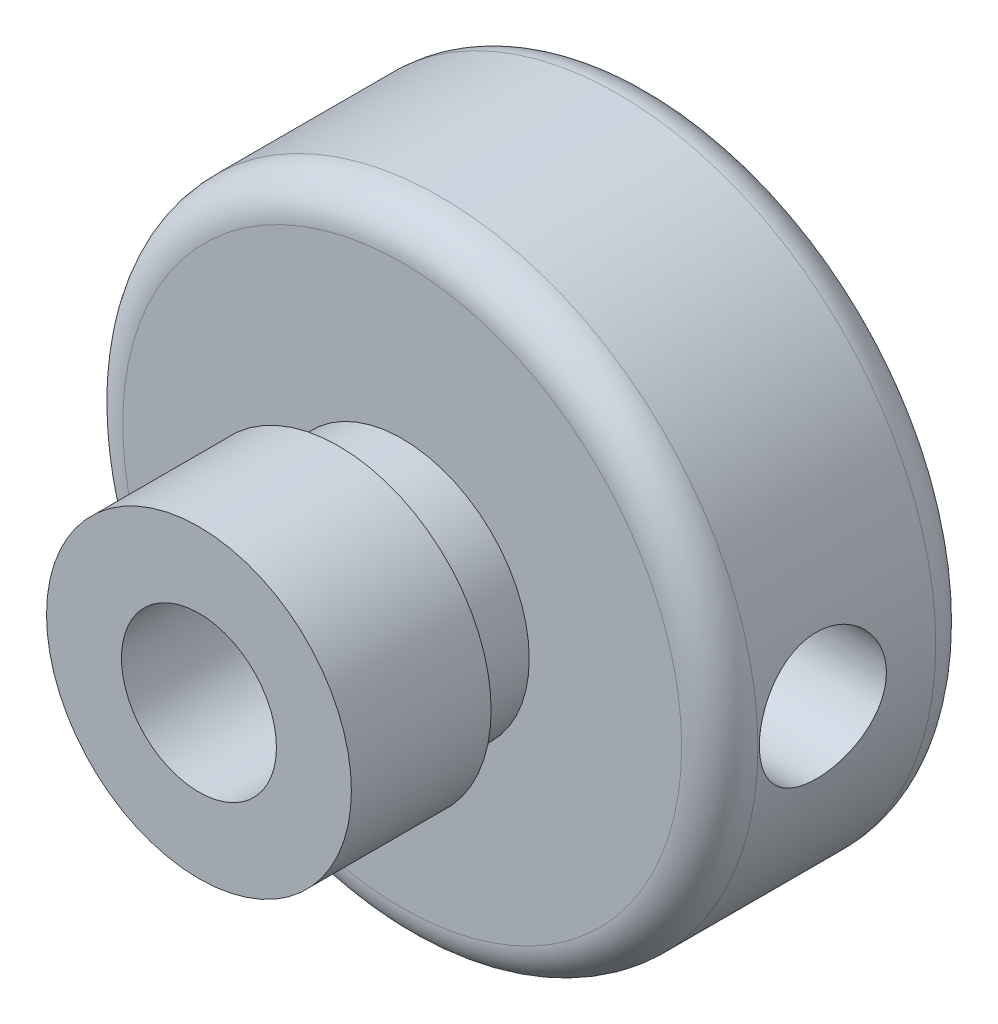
ISO-10303-21;
HEADER;
FILE_DESCRIPTION(('STEP AP214'),'2;1');
FILE_NAME('part.step','',(''),(''),'','','');
FILE_SCHEMA(('AUTOMOTIVE_DESIGN { 1 0 10303 214 1 1 1 1 }'));
ENDSEC;
DATA;
#1=APPLICATION_CONTEXT('core data for automotive mechanical design processes');
#2=APPLICATION_PROTOCOL_DEFINITION('international standard','automotive_design',2000,#1);
#3=PRODUCT_CONTEXT('',#1,'mechanical');
#4=PRODUCT('Part','Part','',(#3));
#5=PRODUCT_RELATED_PRODUCT_CATEGORY('part','',(#4));
#6=PRODUCT_DEFINITION_FORMATION('','',#4);
#7=PRODUCT_DEFINITION_CONTEXT('part definition',#1,'design');
#8=PRODUCT_DEFINITION('design','',#6,#7);
#9=PRODUCT_DEFINITION_SHAPE('','',#8);
#10=(LENGTH_UNIT() NAMED_UNIT(*) SI_UNIT(.MILLI.,.METRE.));
#11=(NAMED_UNIT(*) PLANE_ANGLE_UNIT() SI_UNIT($,.RADIAN.));
#12=(NAMED_UNIT(*) SI_UNIT($,.STERADIAN.) SOLID_ANGLE_UNIT());
#13=UNCERTAINTY_MEASURE_WITH_UNIT(LENGTH_MEASURE(1.E-05),#10,'distance_accuracy_value','');
#14=(GEOMETRIC_REPRESENTATION_CONTEXT(3) GLOBAL_UNCERTAINTY_ASSIGNED_CONTEXT((#13)) GLOBAL_UNIT_ASSIGNED_CONTEXT((#10,
#11,#12)) REPRESENTATION_CONTEXT('',''));
#15=CARTESIAN_POINT('',(0.,0.,0.));
#16=DIRECTION('',(0.,0.,1.));
#17=DIRECTION('',(1.,0.,0.));
#18=AXIS2_PLACEMENT_3D('',#15,#16,#17);
#19=CARTESIAN_POINT('',(0.,0.,0.));
#20=DIRECTION('',(0.,0.,1.));
#21=DIRECTION('',(1.,0.,0.));
#22=AXIS2_PLACEMENT_3D('',#19,#20,#21);
#23=CYLINDRICAL_SURFACE('',#22,3.05);
#24=CARTESIAN_POINT('',(0.,0.,18.));
#25=DIRECTION('',(0.,0.,1.));
#26=DIRECTION('',(1.,0.,0.));
#27=AXIS2_PLACEMENT_3D('',#24,#25,#26);
#28=CIRCLE('',#27,3.05);
#29=CARTESIAN_POINT('',(3.05,0.,18.));
#30=VERTEX_POINT('',#29);
#31=EDGE_CURVE('E136',#30,#30,#28,.T.);
#32=ORIENTED_EDGE('',*,*,#31,.T.);
#33=EDGE_LOOP('',(#32));
#34=FACE_BOUND('',#33,.T.);
#35=CARTESIAN_POINT('',(0.,0.,8.));
#36=DIRECTION('',(0.,0.,-1.));
#37=DIRECTION('',(-1.,0.,0.));
#38=AXIS2_PLACEMENT_3D('',#35,#36,#37);
#39=CIRCLE('',#38,3.05);
#40=CARTESIAN_POINT('',(-3.05,0.,8.));
#41=VERTEX_POINT('',#40);
#42=EDGE_CURVE('E135',#41,#41,#39,.F.);
#43=ORIENTED_EDGE('',*,*,#42,.F.);
#44=EDGE_LOOP('',(#43));
#45=FACE_BOUND('',#44,.T.);
#46=ADVANCED_FACE('F34',(#34,#45),#23,.F.);
#47=CARTESIAN_POINT('',(0.,0.,10.));
#48=DIRECTION('',(0.,0.,-1.));
#49=DIRECTION('',(-1.,0.,0.));
#50=AXIS2_PLACEMENT_3D('',#47,#48,#49);
#51=CYLINDRICAL_SURFACE('',#50,12.5);
#52=CARTESIAN_POINT('',(12.5,0.,3.44238683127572));
#53=CARTESIAN_POINT('',(12.4999974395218,-0.138942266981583,3.44239194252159));
#54=CARTESIAN_POINT('',(12.4976596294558,-0.277949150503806,3.45400893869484));
#55=CARTESIAN_POINT('',(12.4885591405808,-0.552033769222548,3.50013308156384));
#56=CARTESIAN_POINT('',(12.4817929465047,-0.687108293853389,3.5346584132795));
#57=CARTESIAN_POINT('',(12.4645912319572,-0.949325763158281,3.6254900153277));
#58=CARTESIAN_POINT('',(12.454159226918,-1.07647616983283,3.68177542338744));
#59=CARTESIAN_POINT('',(12.4307599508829,-1.31951997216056,3.81446745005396));
#60=CARTESIAN_POINT('',(12.4177928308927,-1.43541403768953,3.89087287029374));
#61=CARTESIAN_POINT('',(12.3905541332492,-1.65423369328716,4.06273306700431));
#62=CARTESIAN_POINT('',(12.3762686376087,-1.75698487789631,4.15840771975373));
#63=CARTESIAN_POINT('',(12.3481045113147,-1.94509189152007,4.36561787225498));
#64=CARTESIAN_POINT('',(12.3342259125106,-2.03044636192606,4.47715460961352));
#65=CARTESIAN_POINT('',(12.3083110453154,-2.18207938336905,4.71417731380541));
#66=CARTESIAN_POINT('',(12.2962926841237,-2.24817734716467,4.83978094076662));
#67=CARTESIAN_POINT('',(12.2756567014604,-2.35826416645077,5.10059137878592));
#68=CARTESIAN_POINT('',(12.267038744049,-2.40225520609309,5.23579723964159));
#69=CARTESIAN_POINT('',(12.2543201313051,-2.46631324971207,5.51009774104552));
#70=CARTESIAN_POINT('',(12.2501617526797,-2.48668624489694,5.64911819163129));
#71=CARTESIAN_POINT('',(12.2466593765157,-2.5038803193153,5.92866138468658));
#72=CARTESIAN_POINT('',(12.247314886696,-2.50070380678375,6.06918397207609));
#73=CARTESIAN_POINT('',(12.2533137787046,-2.47113643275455,6.34550380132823));
#74=CARTESIAN_POINT('',(12.2585863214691,-2.44509635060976,6.48134034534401));
#75=CARTESIAN_POINT('',(12.273113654,-2.37109471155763,6.74667702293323));
#76=CARTESIAN_POINT('',(12.2823686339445,-2.3231321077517,6.87617685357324));
#77=CARTESIAN_POINT('',(12.3038904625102,-2.2063119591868,7.12617498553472));
#78=CARTESIAN_POINT('',(12.3161772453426,-2.13731537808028,7.24660653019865));
#79=CARTESIAN_POINT('',(12.3423654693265,-1.9804839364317,7.47431395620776));
#80=CARTESIAN_POINT('',(12.3562670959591,-1.89264691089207,7.58158832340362));
#81=CARTESIAN_POINT('',(12.3844255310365,-1.69874983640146,7.78196033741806));
#82=CARTESIAN_POINT('',(12.3986842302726,-1.59239040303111,7.87476825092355));
#83=CARTESIAN_POINT('',(12.4257212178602,-1.36546256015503,8.04127144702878));
#84=CARTESIAN_POINT('',(12.4384994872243,-1.24489396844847,8.11496648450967));
#85=CARTESIAN_POINT('',(12.4611672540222,-0.992648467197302,8.24120560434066));
#86=CARTESIAN_POINT('',(12.4710522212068,-0.86095454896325,8.29371656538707));
#87=CARTESIAN_POINT('',(12.4867852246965,-0.590372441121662,8.37578801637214));
#88=CARTESIAN_POINT('',(12.4926337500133,-0.451485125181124,8.40535128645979));
#89=CARTESIAN_POINT('',(12.4995667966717,-0.172948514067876,8.44027796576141));
#90=CARTESIAN_POINT('',(12.5007293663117,-0.0333508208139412,8.44603788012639));
#91=CARTESIAN_POINT('',(12.4983762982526,0.244812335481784,8.43426218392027));
#92=CARTESIAN_POINT('',(12.4948609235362,0.383377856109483,8.41672788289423));
#93=CARTESIAN_POINT('',(12.4835958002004,0.654264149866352,8.35919089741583));
#94=CARTESIAN_POINT('',(12.4758844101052,0.786629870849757,8.31939166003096));
#95=CARTESIAN_POINT('',(12.4570888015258,1.04280906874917,8.2186768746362));
#96=CARTESIAN_POINT('',(12.4460043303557,1.16662190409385,8.15775974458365));
#97=CARTESIAN_POINT('',(12.4214977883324,1.40385293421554,8.01568060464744));
#98=CARTESIAN_POINT('',(12.4080487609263,1.51712531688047,7.93427987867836));
#99=CARTESIAN_POINT('',(12.3803683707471,1.72854504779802,7.75386385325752));
#100=CARTESIAN_POINT('',(12.3661369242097,1.82669077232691,7.65484666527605));
#101=CARTESIAN_POINT('',(12.3382325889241,2.00660147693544,7.44020345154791));
#102=CARTESIAN_POINT('',(12.3245715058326,2.08809425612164,7.32434747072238));
#103=CARTESIAN_POINT('',(12.2996047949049,2.23046355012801,7.08035842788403));
#104=CARTESIAN_POINT('',(12.2882990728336,2.29134088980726,6.95222585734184));
#105=CARTESIAN_POINT('',(12.2694185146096,2.3903796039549,6.68796621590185));
#106=CARTESIAN_POINT('',(12.2618243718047,2.42865874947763,6.55188472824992));
#107=CARTESIAN_POINT('',(12.2511859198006,2.48177162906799,6.27505319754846));
#108=CARTESIAN_POINT('',(12.2481410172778,2.49660842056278,6.13430376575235));
#109=CARTESIAN_POINT('',(12.2469787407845,2.50230227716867,5.85486466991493));
#110=CARTESIAN_POINT('',(12.2487729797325,2.49358947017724,5.7161839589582));
#111=CARTESIAN_POINT('',(12.2568893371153,2.45338076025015,5.44230770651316));
#112=CARTESIAN_POINT('',(12.2632114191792,2.42188504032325,5.30711213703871));
#113=CARTESIAN_POINT('',(12.279631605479,2.33719642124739,5.04431755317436));
#114=CARTESIAN_POINT('',(12.2897205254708,2.28405626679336,4.91670093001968));
#115=CARTESIAN_POINT('',(12.3125428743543,2.15763661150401,4.67212752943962));
#116=CARTESIAN_POINT('',(12.3252765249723,2.08435542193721,4.55517164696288));
#117=CARTESIAN_POINT('',(12.3522240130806,1.91826478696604,4.33309790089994));
#118=CARTESIAN_POINT('',(12.3664593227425,1.82514471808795,4.22821491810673));
#119=CARTESIAN_POINT('',(12.3946520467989,1.62266092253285,4.0354213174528));
#120=CARTESIAN_POINT('',(12.4086093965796,1.51329346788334,3.94751460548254));
#121=CARTESIAN_POINT('',(12.4348458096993,1.28004407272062,3.79030022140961));
#122=CARTESIAN_POINT('',(12.4471057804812,1.15602221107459,3.72119682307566));
#123=CARTESIAN_POINT('',(12.468378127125,0.897915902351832,3.60492152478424));
#124=CARTESIAN_POINT('',(12.4773934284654,0.763840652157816,3.55772985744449));
#125=CARTESIAN_POINT('',(12.4894093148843,0.52455372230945,3.49575696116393));
#126=CARTESIAN_POINT('',(12.4933575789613,0.420704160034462,3.47577884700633));
#127=CARTESIAN_POINT('',(12.4986538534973,0.211248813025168,3.44909205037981));
#128=CARTESIAN_POINT('',(12.5000019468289,0.105643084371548,3.4423829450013));
#129=CARTESIAN_POINT('',(12.5,0.,3.44238683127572));
#130=B_SPLINE_CURVE_WITH_KNOTS('',3,(#52,#53,#54,#55,#56,#57,#58,#59,#60,#61,#62,#63,#64,#65,
#66,#67,#68,#69,#70,#71,#72,#73,#74,#75,#76,#77,#78,#79,#80,#81,#82,#83,#84,#85,#86,#87,#88,#89,
#90,#91,#92,#93,#94,#95,#96,#97,#98,#99,#100,#101,#102,#103,#104,#105,#106,#107,#108,#109,#110,
#111,#112,#113,#114,#115,#116,#117,#118,#119,#120,#121,#122,#123,#124,#125,#126,#127,#128,#129),
.UNSPECIFIED.,.T.,.F.,(4,2,2,2,2,2,2,2,2,2,2,2,2,2,2,2,2,2,2,2,2,2,2,2,2,2,2,2,2,2,2,2,2,2,2,2,
2,2,4),(0.,0.416440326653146,0.833211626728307,1.24958433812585,1.66593225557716,
2.08733167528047,2.50876399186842,2.93402987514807,3.35925373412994,3.77890462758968,
4.19851260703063,4.61179317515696,5.02509348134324,5.44118725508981,5.85732886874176,
6.28095631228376,6.7045891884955,7.12888187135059,7.5531231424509,7.97026839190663,
8.38739019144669,8.80076134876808,9.21416348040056,9.63262665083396,10.0511347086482,
10.4760157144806,10.9008797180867,11.3235095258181,11.7460842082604,12.1609930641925,
12.5758985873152,12.9897990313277,13.4037341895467,13.8247019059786,14.2457663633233,
14.6712374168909,15.096323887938,15.4129693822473,15.7296047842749),.UNSPECIFIED.);
#131=CARTESIAN_POINT('',(12.5,0.,3.44238683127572));
#132=VERTEX_POINT('',#131);
#133=EDGE_CURVE('E113',#132,#132,#130,.T.);
#134=ORIENTED_EDGE('',*,*,#133,.T.);
#135=EDGE_LOOP('',(#134));
#136=FACE_BOUND('',#135,.T.);
#137=CARTESIAN_POINT('',(0.,0.,8.5));
#138=DIRECTION('',(0.,0.,1.));
#139=DIRECTION('',(1.,0.,0.));
#140=AXIS2_PLACEMENT_3D('',#137,#138,#139);
#141=CIRCLE('',#140,12.5);
#142=CARTESIAN_POINT('',(12.5,0.,8.5));
#143=VERTEX_POINT('',#142);
#144=EDGE_CURVE('E152',#143,#143,#141,.F.);
#145=ORIENTED_EDGE('',*,*,#144,.T.);
#146=EDGE_LOOP('',(#145));
#147=FACE_BOUND('',#146,.T.);
#148=CARTESIAN_POINT('',(0.,0.,1.5));
#149=DIRECTION('',(0.,0.,1.));
#150=DIRECTION('',(1.,0.,0.));
#151=AXIS2_PLACEMENT_3D('',#148,#149,#150);
#152=CIRCLE('',#151,12.5);
#153=CARTESIAN_POINT('',(12.5,0.,1.5));
#154=VERTEX_POINT('',#153);
#155=EDGE_CURVE('E149',#154,#154,#152,.T.);
#156=ORIENTED_EDGE('',*,*,#155,.T.);
#157=EDGE_LOOP('',(#156));
#158=FACE_BOUND('',#157,.T.);
#159=ADVANCED_FACE('F36',(#136,#147,#158),#51,.T.);
#160=CARTESIAN_POINT('',(0.,0.,10.));
#161=DIRECTION('',(0.,0.,1.));
#162=DIRECTION('',(1.,0.,0.));
#163=AXIS2_PLACEMENT_3D('',#160,#161,#162);
#164=PLANE('',#163);
#165=CARTESIAN_POINT('',(0.,0.,10.));
#166=DIRECTION('',(0.,0.,1.));
#167=DIRECTION('',(1.,0.,0.));
#168=AXIS2_PLACEMENT_3D('',#165,#166,#167);
#169=CIRCLE('',#168,11.);
#170=CARTESIAN_POINT('',(11.,0.,10.));
#171=VERTEX_POINT('',#170);
#172=EDGE_CURVE('E142',#171,#171,#169,.T.);
#173=ORIENTED_EDGE('',*,*,#172,.T.);
#174=EDGE_LOOP('',(#173));
#175=FACE_BOUND('',#174,.T.);
#176=CARTESIAN_POINT('',(0.,0.,10.));
#177=DIRECTION('',(0.,0.,1.));
#178=DIRECTION('',(1.,0.,0.));
#179=AXIS2_PLACEMENT_3D('',#176,#177,#178);
#180=CIRCLE('',#179,5.);
#181=CARTESIAN_POINT('',(5.,0.,10.));
#182=VERTEX_POINT('',#181);
#183=EDGE_CURVE('E120',#182,#182,#180,.T.);
#184=ORIENTED_EDGE('',*,*,#183,.F.);
#185=EDGE_LOOP('',(#184));
#186=FACE_BOUND('',#185,.T.);
#187=ADVANCED_FACE('F166',(#175,#186),#164,.T.);
#188=CARTESIAN_POINT('',(0.,0.,0.));
#189=DIRECTION('',(0.,0.,1.));
#190=DIRECTION('',(1.,0.,0.));
#191=AXIS2_PLACEMENT_3D('',#188,#189,#190);
#192=PLANE('',#191);
#193=CARTESIAN_POINT('',(0.,0.,0.));
#194=DIRECTION('',(0.,0.,1.));
#195=DIRECTION('',(1.,0.,0.));
#196=AXIS2_PLACEMENT_3D('',#193,#194,#195);
#197=CIRCLE('',#196,11.);
#198=CARTESIAN_POINT('',(11.,0.,0.));
#199=VERTEX_POINT('',#198);
#200=EDGE_CURVE('E80',#199,#199,#197,.F.);
#201=ORIENTED_EDGE('',*,*,#200,.T.);
#202=EDGE_LOOP('',(#201));
#203=FACE_BOUND('',#202,.T.);
#204=CARTESIAN_POINT('',(0.,0.,0.));
#205=DIRECTION('',(0.,0.,-1.));
#206=DIRECTION('',(-1.,0.,0.));
#207=AXIS2_PLACEMENT_3D('',#204,#205,#206);
#208=CIRCLE('',#207,5.);
#209=CARTESIAN_POINT('',(-5.,0.,0.));
#210=VERTEX_POINT('',#209);
#211=EDGE_CURVE('E129',#210,#210,#208,.T.);
#212=ORIENTED_EDGE('',*,*,#211,.F.);
#213=EDGE_LOOP('',(#212));
#214=FACE_BOUND('',#213,.T.);
#215=ADVANCED_FACE('F157',(#203,#214),#192,.F.);
#216=CARTESIAN_POINT('',(0.,0.,18.));
#217=DIRECTION('',(0.,0.,-1.));
#218=DIRECTION('',(-1.,0.,0.));
#219=AXIS2_PLACEMENT_3D('',#216,#217,#218);
#220=CYLINDRICAL_SURFACE('',#219,6.);
#221=CARTESIAN_POINT('',(0.,0.,12.5));
#222=DIRECTION('',(0.,0.,1.));
#223=DIRECTION('',(1.,0.,0.));
#224=AXIS2_PLACEMENT_3D('',#221,#222,#223);
#225=CIRCLE('',#224,6.);
#226=CARTESIAN_POINT('',(6.,0.,12.5));
#227=VERTEX_POINT('',#226);
#228=EDGE_CURVE('E128',#227,#227,#225,.T.);
#229=ORIENTED_EDGE('',*,*,#228,.T.);
#230=EDGE_LOOP('',(#229));
#231=FACE_BOUND('',#230,.T.);
#232=CARTESIAN_POINT('',(0.,0.,18.));
#233=DIRECTION('',(0.,0.,1.));
#234=DIRECTION('',(1.,0.,0.));
#235=AXIS2_PLACEMENT_3D('',#232,#233,#234);
#236=CIRCLE('',#235,6.);
#237=CARTESIAN_POINT('',(6.,0.,18.));
#238=VERTEX_POINT('',#237);
#239=EDGE_CURVE('E139',#238,#238,#236,.T.);
#240=ORIENTED_EDGE('',*,*,#239,.F.);
#241=EDGE_LOOP('',(#240));
#242=FACE_BOUND('',#241,.T.);
#243=ADVANCED_FACE('F176',(#231,#242),#220,.T.);
#244=CARTESIAN_POINT('',(0.,0.,18.));
#245=DIRECTION('',(0.,0.,1.));
#246=DIRECTION('',(1.,0.,0.));
#247=AXIS2_PLACEMENT_3D('',#244,#245,#246);
#248=PLANE('',#247);
#249=ORIENTED_EDGE('',*,*,#31,.F.);
#250=EDGE_LOOP('',(#249));
#251=FACE_BOUND('',#250,.T.);
#252=ORIENTED_EDGE('',*,*,#239,.T.);
#253=EDGE_LOOP('',(#252));
#254=FACE_BOUND('',#253,.T.);
#255=ADVANCED_FACE('F178',(#251,#254),#248,.T.);
#256=CARTESIAN_POINT('',(0.,0.,8.));
#257=DIRECTION('',(0.,0.,-1.));
#258=DIRECTION('',(-1.,0.,0.));
#259=AXIS2_PLACEMENT_3D('',#256,#257,#258);
#260=PLANE('',#259);
#261=DIRECTION('',(1.,0.,0.));
#262=VECTOR('',#261,1.);
#263=CARTESIAN_POINT('',(4.5,1.41993945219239,8.));
#264=LINE('',#263,#262);
#265=CARTESIAN_POINT('',(4.5,1.41993945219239,8.));
#266=VERTEX_POINT('',#265);
#267=CARTESIAN_POINT('',(4.79413933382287,1.41993945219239,8.));
#268=VERTEX_POINT('',#267);
#269=EDGE_CURVE('E321',#266,#268,#264,.T.);
#270=ORIENTED_EDGE('',*,*,#269,.F.);
#271=DIRECTION('',(0.,-1.,0.));
#272=VECTOR('',#271,1.);
#273=CARTESIAN_POINT('',(4.5,0.,8.));
#274=LINE('',#273,#272);
#275=CARTESIAN_POINT('',(4.5,-1.41993945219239,8.));
#276=VERTEX_POINT('',#275);
#277=EDGE_CURVE('E85',#266,#276,#274,.T.);
#278=ORIENTED_EDGE('',*,*,#277,.T.);
#279=DIRECTION('',(1.,0.,0.));
#280=VECTOR('',#279,1.);
#281=CARTESIAN_POINT('',(4.5,-1.41993945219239,8.));
#282=LINE('',#281,#280);
#283=CARTESIAN_POINT('',(4.79413933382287,-1.41993945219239,8.));
#284=VERTEX_POINT('',#283);
#285=EDGE_CURVE('E121',#284,#276,#282,.F.);
#286=ORIENTED_EDGE('',*,*,#285,.F.);
#287=CARTESIAN_POINT('',(0.,0.,8.));
#288=DIRECTION('',(0.,0.,-1.));
#289=DIRECTION('',(-1.,0.,0.));
#290=AXIS2_PLACEMENT_3D('',#287,#288,#289);
#291=CIRCLE('',#290,5.);
#292=EDGE_CURVE('E132',#284,#268,#291,.T.);
#293=ORIENTED_EDGE('',*,*,#292,.T.);
#294=EDGE_LOOP('',(#270,#278,#286,#293));
#295=FACE_BOUND('',#294,.T.);
#296=ORIENTED_EDGE('',*,*,#42,.T.);
#297=EDGE_LOOP('',(#296));
#298=FACE_BOUND('',#297,.T.);
#299=ADVANCED_FACE('F184',(#295,#298),#260,.T.);
#300=CARTESIAN_POINT('',(0.,0.,8.));
#301=DIRECTION('',(0.,0.,-1.));
#302=DIRECTION('',(-1.,0.,0.));
#303=AXIS2_PLACEMENT_3D('',#300,#301,#302);
#304=CYLINDRICAL_SURFACE('',#303,5.);
#305=ORIENTED_EDGE('',*,*,#292,.F.);
#306=CARTESIAN_POINT('',(4.79413933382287,-1.41993945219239,8.));
#307=CARTESIAN_POINT('',(4.77655996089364,-1.47930136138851,7.95902831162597));
#308=CARTESIAN_POINT('',(4.75834782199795,-1.53673101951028,7.91560960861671));
#309=CARTESIAN_POINT('',(4.721143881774,-1.64748584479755,7.82413006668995));
#310=CARTESIAN_POINT('',(4.70215215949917,-1.70081142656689,7.77606969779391));
#311=CARTESIAN_POINT('',(4.64461872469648,-1.85458883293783,7.62499668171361));
#312=CARTESIAN_POINT('',(4.60562720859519,-1.9484913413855,7.51533455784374));
#313=CARTESIAN_POINT('',(4.53087047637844,-2.11653142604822,7.28072575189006));
#314=CARTESIAN_POINT('',(4.49510759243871,-2.19065478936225,7.1557681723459));
#315=CARTESIAN_POINT('',(4.4315055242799,-2.31662578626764,6.89335805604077));
#316=CARTESIAN_POINT('',(4.40365267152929,-2.36851192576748,6.75592762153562));
#317=CARTESIAN_POINT('',(4.36133359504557,-2.44553191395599,6.47978817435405));
#318=CARTESIAN_POINT('',(4.34623305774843,-2.47194412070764,6.34153763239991));
#319=CARTESIAN_POINT('',(4.32953111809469,-2.50109478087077,6.06177643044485));
#320=CARTESIAN_POINT('',(4.32791972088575,-2.50385076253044,5.92026826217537));
#321=CARTESIAN_POINT('',(4.33780652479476,-2.48666036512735,5.65617140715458));
#322=CARTESIAN_POINT('',(4.3477654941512,-2.46938001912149,5.53333753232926));
#323=CARTESIAN_POINT('',(4.37697426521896,-2.41722577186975,5.29262366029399));
#324=CARTESIAN_POINT('',(4.39622663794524,-2.38234700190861,5.17474504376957));
#325=CARTESIAN_POINT('',(4.44228064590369,-2.29534360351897,4.94389742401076));
#326=CARTESIAN_POINT('',(4.46924874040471,-2.24283370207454,4.83110839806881));
#327=CARTESIAN_POINT('',(4.52770293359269,-2.12235364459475,4.61539960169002));
#328=CARTESIAN_POINT('',(4.55919108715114,-2.05437644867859,4.51248435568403));
#329=CARTESIAN_POINT('',(4.62796234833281,-1.89484063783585,4.30570720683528));
#330=CARTESIAN_POINT('',(4.66547398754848,-1.80138486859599,4.20337990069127));
#331=CARTESIAN_POINT('',(4.73882765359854,-1.59848434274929,4.01521191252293));
#332=CARTESIAN_POINT('',(4.77466887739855,-1.48903199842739,3.92937909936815));
#333=CARTESIAN_POINT('',(4.8426724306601,-1.25081753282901,3.77289954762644));
#334=CARTESIAN_POINT('',(4.8745872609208,-1.12139556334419,3.70314102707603));
#335=CARTESIAN_POINT('',(4.9290357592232,-0.850653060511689,3.58695916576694));
#336=CARTESIAN_POINT('',(4.95157688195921,-0.709342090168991,3.54051727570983));
#337=CARTESIAN_POINT('',(4.98315387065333,-0.431389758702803,3.47610663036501));
#338=CARTESIAN_POINT('',(4.99315413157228,-0.295331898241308,3.45609721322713));
#339=CARTESIAN_POINT('',(5.00182731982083,-0.0214421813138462,3.43872111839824));
#340=CARTESIAN_POINT('',(5.00050560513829,0.116388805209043,3.44134373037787));
#341=CARTESIAN_POINT('',(4.98724343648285,0.37856028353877,3.46797676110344));
#342=CARTESIAN_POINT('',(4.97613341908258,0.503118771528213,3.49031478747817));
#343=CARTESIAN_POINT('',(4.94548596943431,0.746468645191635,3.5531231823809));
#344=CARTESIAN_POINT('',(4.92594760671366,0.865259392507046,3.59359555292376));
#345=CARTESIAN_POINT('',(4.87951119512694,1.09764396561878,3.69258879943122));
#346=CARTESIAN_POINT('',(4.85241826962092,1.21099127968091,3.7515936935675));
#347=CARTESIAN_POINT('',(4.79348089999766,1.42655099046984,3.88543106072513));
#348=CARTESIAN_POINT('',(4.76163443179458,1.52875861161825,3.96027028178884));
#349=CARTESIAN_POINT('',(4.69257158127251,1.72978202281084,4.13213393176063));
#350=CARTESIAN_POINT('',(4.6551349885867,1.82727880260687,4.23061535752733));
#351=CARTESIAN_POINT('',(4.58142133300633,2.00495649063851,4.44262087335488));
#352=CARTESIAN_POINT('',(4.54514508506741,2.08512544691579,4.55615525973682));
#353=CARTESIAN_POINT('',(4.47615580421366,2.22951771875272,4.80198066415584));
#354=CARTESIAN_POINT('',(4.44369984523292,2.29278268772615,4.93491314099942));
#355=CARTESIAN_POINT('',(4.38926462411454,2.39536604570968,5.21168285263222));
#356=CARTESIAN_POINT('',(4.36727194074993,2.4347151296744,5.35550584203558));
#357=CARTESIAN_POINT('',(4.33899980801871,2.48471969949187,5.63519512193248));
#358=CARTESIAN_POINT('',(4.33141395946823,2.49776825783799,5.77049873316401));
#359=CARTESIAN_POINT('',(4.32914579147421,2.50170219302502,6.04150658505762));
#360=CARTESIAN_POINT('',(4.33445739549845,2.49259800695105,6.17721060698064));
#361=CARTESIAN_POINT('',(4.35599736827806,2.45472539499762,6.43154464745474));
#362=CARTESIAN_POINT('',(4.37113780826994,2.42791243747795,6.55056984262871));
#363=CARTESIAN_POINT('',(4.40935464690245,2.3577904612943,6.78232252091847));
#364=CARTESIAN_POINT('',(4.43243483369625,2.31447356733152,6.89504696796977));
#365=CARTESIAN_POINT('',(4.48582781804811,2.20930852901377,7.11938925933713));
#366=CARTESIAN_POINT('',(4.51652371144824,2.14640672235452,7.23041859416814));
#367=CARTESIAN_POINT('',(4.58103434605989,2.00503126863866,7.44103097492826));
#368=CARTESIAN_POINT('',(4.61484884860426,1.92655881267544,7.5406148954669));
#369=CARTESIAN_POINT('',(4.67365734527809,1.77806528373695,7.70226257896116));
#370=CARTESIAN_POINT('',(4.69863273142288,1.71124747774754,7.76730687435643));
#371=CARTESIAN_POINT('',(4.74747824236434,1.57067077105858,7.88960314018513));
#372=CARTESIAN_POINT('',(4.77135011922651,1.49692347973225,7.94686776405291));
#373=CARTESIAN_POINT('',(4.79413933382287,1.41993945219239,8.));
#374=B_SPLINE_CURVE_WITH_KNOTS('',3,(#306,#307,#308,#309,#310,#311,#312,#313,#314,#315,#316,
#317,#318,#319,#320,#321,#322,#323,#324,#325,#326,#327,#328,#329,#330,#331,#332,#333,#334,#335,
#336,#337,#338,#339,#340,#341,#342,#343,#344,#345,#346,#347,#348,#349,#350,#351,#352,#353,#354,
#355,#356,#357,#358,#359,#360,#361,#362,#363,#364,#365,#366,#367,#368,#369,#370,#371,#372,#373),
.UNSPECIFIED.,.F.,.F.,(4,2,2,2,2,2,2,2,2,2,2,2,2,2,2,2,2,2,2,2,2,2,2,2,2,2,2,2,2,2,2,2,2,4),(0.,
0.222567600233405,0.445112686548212,0.89150449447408,1.33821621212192,1.78415124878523,
2.20632081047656,2.62817753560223,2.99976672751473,3.37145877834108,3.75186790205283,
4.1324505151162,4.56129004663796,4.99033365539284,5.43926245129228,5.88783353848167,
6.29923089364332,6.7104335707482,7.08978529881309,7.46917891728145,7.85944575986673,
8.24987925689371,8.67865864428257,9.10773284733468,9.55755210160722,10.0067928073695,
10.4128824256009,10.8187807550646,11.1860200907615,11.5534348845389,11.9456549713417,
12.3378450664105,12.626911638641,12.9155022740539),.UNSPECIFIED.);
#375=CARTESIAN_POINT('',(4.5,-2.17944947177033,7.16713170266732));
#376=VERTEX_POINT('',#375);
#377=EDGE_CURVE('E11',#284,#376,#374,.T.);
#378=ORIENTED_EDGE('',*,*,#377,.T.);
#379=DIRECTION('',(0.,0.,-1.));
#380=VECTOR('',#379,1.);
#381=CARTESIAN_POINT('',(4.5,-2.17944947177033,8.));
#382=LINE('',#381,#380);
#383=CARTESIAN_POINT('',(4.5,-2.17944947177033,4.71764195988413));
#384=VERTEX_POINT('',#383);
#385=EDGE_CURVE('E39',#384,#376,#382,.F.);
#386=ORIENTED_EDGE('',*,*,#385,.F.);
#387=CARTESIAN_POINT('',(4.5,2.17944947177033,4.71764195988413));
#388=VERTEX_POINT('',#387);
#389=EDGE_CURVE('E44',#384,#388,#374,.T.);
#390=ORIENTED_EDGE('',*,*,#389,.T.);
#391=DIRECTION('',(0.,0.,-1.));
#392=VECTOR('',#391,1.);
#393=CARTESIAN_POINT('',(4.5,2.17944947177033,8.));
#394=LINE('',#393,#392);
#395=CARTESIAN_POINT('',(4.5,2.17944947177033,7.16713170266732));
#396=VERTEX_POINT('',#395);
#397=EDGE_CURVE('E75',#396,#388,#394,.T.);
#398=ORIENTED_EDGE('',*,*,#397,.F.);
#399=EDGE_CURVE('E45',#396,#268,#374,.T.);
#400=ORIENTED_EDGE('',*,*,#399,.T.);
#401=EDGE_LOOP('',(#305,#378,#386,#390,#398,#400));
#402=FACE_BOUND('',#401,.T.);
#403=ORIENTED_EDGE('',*,*,#211,.T.);
#404=EDGE_LOOP('',(#403));
#405=FACE_BOUND('',#404,.T.);
#406=ADVANCED_FACE('F91',(#402,#405),#304,.F.);
#407=CARTESIAN_POINT('',(0.,5.,12.5));
#408=DIRECTION('',(0.,0.,1.));
#409=DIRECTION('',(1.,0.,0.));
#410=AXIS2_PLACEMENT_3D('',#407,#408,#409);
#411=PLANE('',#410);
#412=CARTESIAN_POINT('',(0.,0.,12.5));
#413=DIRECTION('',(0.,0.,1.));
#414=DIRECTION('',(1.,0.,0.));
#415=AXIS2_PLACEMENT_3D('',#412,#413,#414);
#416=CIRCLE('',#415,5.);
#417=CARTESIAN_POINT('',(5.,0.,12.5));
#418=VERTEX_POINT('',#417);
#419=EDGE_CURVE('E125',#418,#418,#416,.T.);
#420=ORIENTED_EDGE('',*,*,#419,.T.);
#421=EDGE_LOOP('',(#420));
#422=FACE_BOUND('',#421,.T.);
#423=ORIENTED_EDGE('',*,*,#228,.F.);
#424=EDGE_LOOP('',(#423));
#425=FACE_BOUND('',#424,.T.);
#426=ADVANCED_FACE('F202',(#422,#425),#411,.F.);
#427=CARTESIAN_POINT('',(0.,0.,21.3998267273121));
#428=DIRECTION('',(0.,0.,1.));
#429=DIRECTION('',(1.,0.,0.));
#430=AXIS2_PLACEMENT_3D('',#427,#428,#429);
#431=CYLINDRICAL_SURFACE('',#430,5.);
#432=ORIENTED_EDGE('',*,*,#183,.T.);
#433=EDGE_LOOP('',(#432));
#434=FACE_BOUND('',#433,.T.);
#435=ORIENTED_EDGE('',*,*,#419,.F.);
#436=EDGE_LOOP('',(#435));
#437=FACE_BOUND('',#436,.T.);
#438=ADVANCED_FACE('F207',(#434,#437),#431,.T.);
#439=CARTESIAN_POINT('',(0.,0.,8.5));
#440=DIRECTION('',(0.,0.,1.));
#441=DIRECTION('',(1.,0.,0.));
#442=AXIS2_PLACEMENT_3D('',#439,#440,#441);
#443=TOROIDAL_SURFACE('',#442,11.,1.5);
#444=ORIENTED_EDGE('',*,*,#144,.F.);
#445=EDGE_LOOP('',(#444));
#446=FACE_BOUND('',#445,.T.);
#447=ORIENTED_EDGE('',*,*,#172,.F.);
#448=EDGE_LOOP('',(#447));
#449=FACE_BOUND('',#448,.T.);
#450=ADVANCED_FACE('F162',(#446,#449),#443,.T.);
#451=CARTESIAN_POINT('',(0.,0.,1.5));
#452=DIRECTION('',(0.,0.,1.));
#453=DIRECTION('',(1.,0.,0.));
#454=AXIS2_PLACEMENT_3D('',#451,#452,#453);
#455=TOROIDAL_SURFACE('',#454,11.,1.5);
#456=ORIENTED_EDGE('',*,*,#200,.F.);
#457=EDGE_LOOP('',(#456));
#458=FACE_BOUND('',#457,.T.);
#459=ORIENTED_EDGE('',*,*,#155,.F.);
#460=EDGE_LOOP('',(#459));
#461=FACE_BOUND('',#460,.T.);
#462=ADVANCED_FACE('F108',(#458,#461),#455,.T.);
#463=CARTESIAN_POINT('',(4.5,0.,5.94238683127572));
#464=DIRECTION('',(1.,0.,0.));
#465=DIRECTION('',(0.,0.,-1.));
#466=AXIS2_PLACEMENT_3D('',#463,#464,#465);
#467=CYLINDRICAL_SURFACE('',#466,2.5);
#468=ORIENTED_EDGE('',*,*,#285,.T.);
#469=CARTESIAN_POINT('',(4.5,0.,5.94238683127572));
#470=DIRECTION('',(1.,0.,0.));
#471=DIRECTION('',(0.,0.,-1.));
#472=AXIS2_PLACEMENT_3D('',#469,#470,#471);
#473=CIRCLE('',#472,2.5);
#474=EDGE_CURVE('E86',#266,#276,#473,.T.);
#475=ORIENTED_EDGE('',*,*,#474,.F.);
#476=ORIENTED_EDGE('',*,*,#269,.T.);
#477=ORIENTED_EDGE('',*,*,#399,.F.);
#478=EDGE_CURVE('E51',#388,#396,#473,.T.);
#479=ORIENTED_EDGE('',*,*,#478,.F.);
#480=ORIENTED_EDGE('',*,*,#389,.F.);
#481=EDGE_CURVE('E88',#376,#384,#473,.T.);
#482=ORIENTED_EDGE('',*,*,#481,.F.);
#483=ORIENTED_EDGE('',*,*,#377,.F.);
#484=EDGE_LOOP('',(#468,#475,#476,#477,#479,#480,#482,#483));
#485=FACE_BOUND('',#484,.T.);
#486=ORIENTED_EDGE('',*,*,#133,.F.);
#487=EDGE_LOOP('',(#486));
#488=FACE_BOUND('',#487,.T.);
#489=ADVANCED_FACE('F82',(#485,#488),#467,.F.);
#490=CARTESIAN_POINT('',(4.5,0.,5.94238683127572));
#491=DIRECTION('',(1.,0.,0.));
#492=DIRECTION('',(0.,0.,-1.));
#493=AXIS2_PLACEMENT_3D('',#490,#491,#492);
#494=PLANE('',#493);
#495=ORIENTED_EDGE('',*,*,#385,.T.);
#496=ORIENTED_EDGE('',*,*,#481,.T.);
#497=EDGE_LOOP('',(#495,#496));
#498=FACE_BOUND('',#497,.T.);
#499=ADVANCED_FACE('F107',(#498),#494,.T.);
#500=ORIENTED_EDGE('',*,*,#397,.T.);
#501=ORIENTED_EDGE('',*,*,#478,.T.);
#502=EDGE_LOOP('',(#500,#501));
#503=FACE_BOUND('',#502,.T.);
#504=ADVANCED_FACE('F76',(#503),#494,.T.);
#505=ORIENTED_EDGE('',*,*,#474,.T.);
#506=ORIENTED_EDGE('',*,*,#277,.F.);
#507=EDGE_LOOP('',(#505,#506));
#508=FACE_BOUND('',#507,.T.);
#509=ADVANCED_FACE('F109',(#508),#494,.T.);
#510=CLOSED_SHELL('',(#46,#159,#187,#215,#243,#255,#299,#406,#426,#438,#450,#462,#489,#499,#504,#509));
#511=MANIFOLD_SOLID_BREP('B2',#510);
#512=ADVANCED_BREP_SHAPE_REPRESENTATION('',(#18,#511),#14);
#513=SHAPE_DEFINITION_REPRESENTATION(#9,#512);
ENDSEC;
END-ISO-10303-21;
